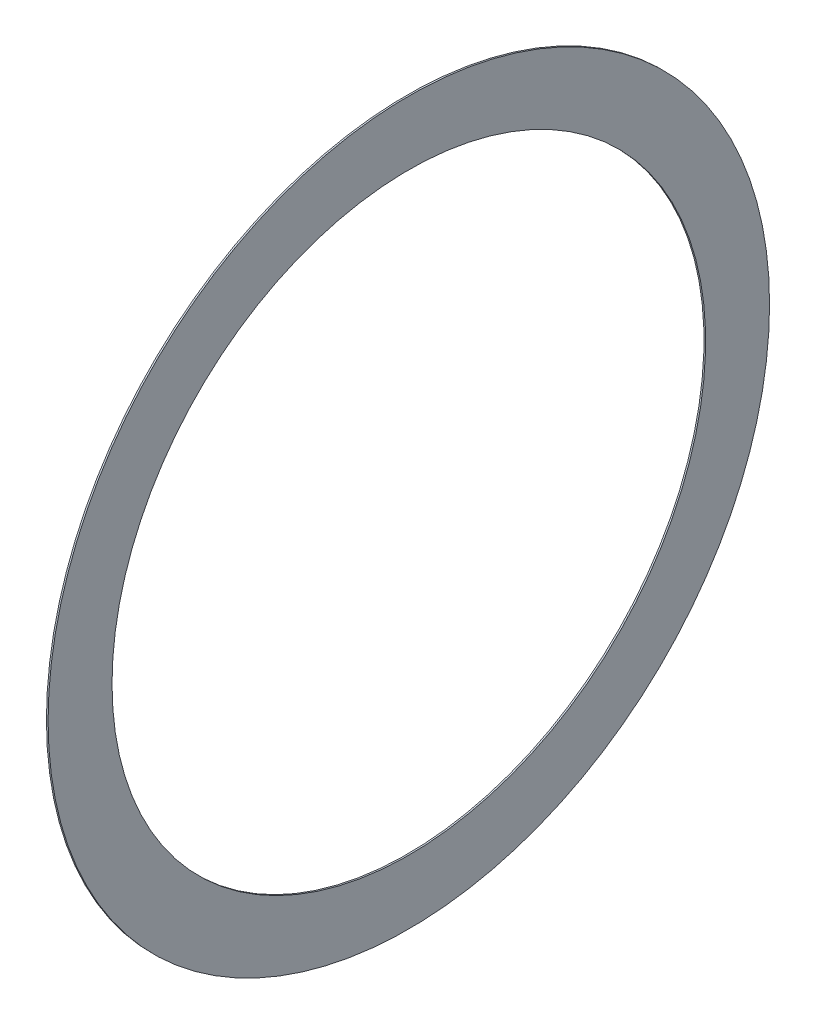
ISO-10303-21;
HEADER;
FILE_DESCRIPTION(('STEP AP214'),'2;1');
FILE_NAME('part.step','',(''),(''),'','','');
FILE_SCHEMA(('AUTOMOTIVE_DESIGN { 1 0 10303 214 1 1 1 1 }'));
ENDSEC;
DATA;
#1=APPLICATION_CONTEXT('core data for automotive mechanical design processes');
#2=APPLICATION_PROTOCOL_DEFINITION('international standard','automotive_design',2000,#1);
#3=PRODUCT_CONTEXT('',#1,'mechanical');
#4=PRODUCT('Part','Part','',(#3));
#5=PRODUCT_RELATED_PRODUCT_CATEGORY('part','',(#4));
#6=PRODUCT_DEFINITION_FORMATION('','',#4);
#7=PRODUCT_DEFINITION_CONTEXT('part definition',#1,'design');
#8=PRODUCT_DEFINITION('design','',#6,#7);
#9=PRODUCT_DEFINITION_SHAPE('','',#8);
#10=(LENGTH_UNIT() NAMED_UNIT(*) SI_UNIT(.MILLI.,.METRE.));
#11=(NAMED_UNIT(*) PLANE_ANGLE_UNIT() SI_UNIT($,.RADIAN.));
#12=(NAMED_UNIT(*) SI_UNIT($,.STERADIAN.) SOLID_ANGLE_UNIT());
#13=UNCERTAINTY_MEASURE_WITH_UNIT(LENGTH_MEASURE(1.E-05),#10,'distance_accuracy_value','');
#14=(GEOMETRIC_REPRESENTATION_CONTEXT(3) GLOBAL_UNCERTAINTY_ASSIGNED_CONTEXT((#13)) GLOBAL_UNIT_ASSIGNED_CONTEXT((#10,
#11,#12)) REPRESENTATION_CONTEXT('',''));
#15=CARTESIAN_POINT('',(0.,0.,0.));
#16=DIRECTION('',(0.,0.,1.));
#17=DIRECTION('',(1.,0.,0.));
#18=AXIS2_PLACEMENT_3D('',#15,#16,#17);
#19=CARTESIAN_POINT('',(0.,55.,0.));
#20=DIRECTION('',(1.,0.,0.));
#21=DIRECTION('',(0.,0.,-1.));
#22=AXIS2_PLACEMENT_3D('',#19,#20,#21);
#23=PLANE('',#22);
#24=CARTESIAN_POINT('',(0.,0.,0.));
#25=DIRECTION('',(-1.,0.,0.));
#26=DIRECTION('',(0.,0.,1.));
#27=AXIS2_PLACEMENT_3D('',#24,#25,#26);
#28=CIRCLE('',#27,45.25);
#29=CARTESIAN_POINT('',(0.,0.,45.25));
#30=VERTEX_POINT('',#29);
#31=EDGE_CURVE('E10',#30,#30,#28,.T.);
#32=ORIENTED_EDGE('',*,*,#31,.F.);
#33=EDGE_LOOP('',(#32));
#34=FACE_BOUND('',#33,.T.);
#35=CARTESIAN_POINT('',(0.,0.,0.));
#36=DIRECTION('',(-1.,0.,0.));
#37=DIRECTION('',(0.,0.,1.));
#38=AXIS2_PLACEMENT_3D('',#35,#36,#37);
#39=CIRCLE('',#38,55.);
#40=CARTESIAN_POINT('',(0.,0.,55.));
#41=VERTEX_POINT('',#40);
#42=EDGE_CURVE('E43',#41,#41,#39,.T.);
#43=ORIENTED_EDGE('',*,*,#42,.T.);
#44=EDGE_LOOP('',(#43));
#45=FACE_BOUND('',#44,.T.);
#46=ADVANCED_FACE('F29',(#34,#45),#23,.F.);
#47=CARTESIAN_POINT('',(0.,0.,0.));
#48=DIRECTION('',(-1.,0.,0.));
#49=DIRECTION('',(0.,0.,1.));
#50=AXIS2_PLACEMENT_3D('',#47,#48,#49);
#51=CYLINDRICAL_SURFACE('',#50,45.25);
#52=CARTESIAN_POINT('',(0.250000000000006,0.,0.));
#53=DIRECTION('',(-1.,0.,0.));
#54=DIRECTION('',(0.,0.,1.));
#55=AXIS2_PLACEMENT_3D('',#52,#53,#54);
#56=CIRCLE('',#55,45.25);
#57=CARTESIAN_POINT('',(0.250000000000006,0.,45.25));
#58=VERTEX_POINT('',#57);
#59=EDGE_CURVE('E35',#58,#58,#56,.T.);
#60=ORIENTED_EDGE('',*,*,#59,.F.);
#61=EDGE_LOOP('',(#60));
#62=FACE_BOUND('',#61,.T.);
#63=ORIENTED_EDGE('',*,*,#31,.T.);
#64=EDGE_LOOP('',(#63));
#65=FACE_BOUND('',#64,.T.);
#66=ADVANCED_FACE('F58',(#62,#65),#51,.F.);
#67=CARTESIAN_POINT('',(0.250000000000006,55.,0.));
#68=DIRECTION('',(-1.,0.,0.));
#69=DIRECTION('',(0.,0.,1.));
#70=AXIS2_PLACEMENT_3D('',#67,#68,#69);
#71=PLANE('',#70);
#72=CARTESIAN_POINT('',(0.250000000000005,0.,0.));
#73=DIRECTION('',(-1.,0.,0.));
#74=DIRECTION('',(0.,0.,1.));
#75=AXIS2_PLACEMENT_3D('',#72,#73,#74);
#76=CIRCLE('',#75,55.);
#77=CARTESIAN_POINT('',(0.250000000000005,0.,55.));
#78=VERTEX_POINT('',#77);
#79=EDGE_CURVE('E39',#78,#78,#76,.T.);
#80=ORIENTED_EDGE('',*,*,#79,.F.);
#81=EDGE_LOOP('',(#80));
#82=FACE_BOUND('',#81,.T.);
#83=ORIENTED_EDGE('',*,*,#59,.T.);
#84=EDGE_LOOP('',(#83));
#85=FACE_BOUND('',#84,.T.);
#86=ADVANCED_FACE('F53',(#82,#85),#71,.F.);
#87=CARTESIAN_POINT('',(0.,0.,0.));
#88=DIRECTION('',(-1.,0.,0.));
#89=DIRECTION('',(0.,0.,1.));
#90=AXIS2_PLACEMENT_3D('',#87,#88,#89);
#91=CYLINDRICAL_SURFACE('',#90,55.);
#92=ORIENTED_EDGE('',*,*,#42,.F.);
#93=EDGE_LOOP('',(#92));
#94=FACE_BOUND('',#93,.T.);
#95=ORIENTED_EDGE('',*,*,#79,.T.);
#96=EDGE_LOOP('',(#95));
#97=FACE_BOUND('',#96,.T.);
#98=ADVANCED_FACE('F50',(#94,#97),#91,.T.);
#99=CLOSED_SHELL('',(#46,#66,#86,#98));
#100=MANIFOLD_SOLID_BREP('B2',#99);
#101=ADVANCED_BREP_SHAPE_REPRESENTATION('',(#18,#100),#14);
#102=SHAPE_DEFINITION_REPRESENTATION(#9,#101);
ENDSEC;
END-ISO-10303-21;
